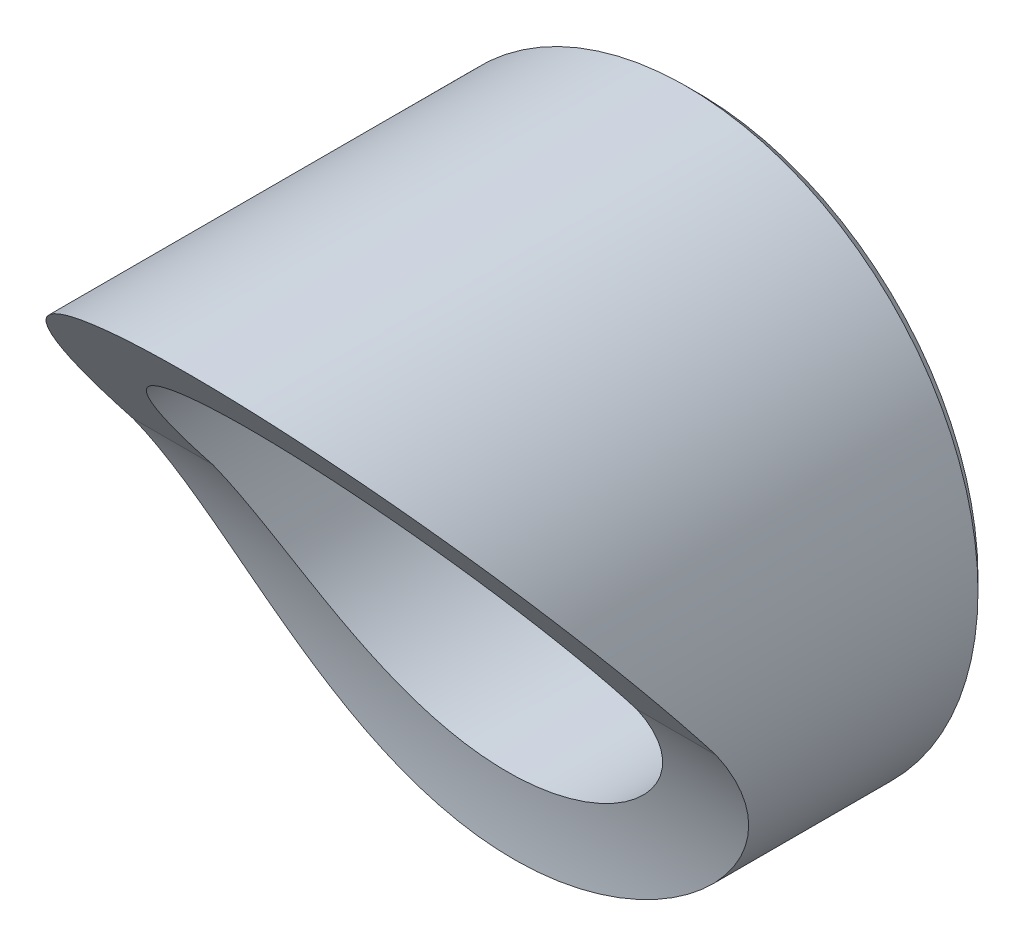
from build123d import *

# Parameters (mm, degrees)
SKETCH_1_R                    = 12
EXTRUDE_1_DEPTH               = 21
CUT_EXTRUDE_1_DEPTH           = 50
CHAMFER_1_SIZE                = 0.5
HOLE_WIZARD_M20_1_D           = 17.5
HOLE_WIZARD_M20_1_CSINK_D     = 20.05
HOLE_WIZARD_M20_1_CSINK_ANGLE = 90


with BuildPart() as part:
    # Sketch 1 → Extrude 1 (new body)
    with BuildSketch(Plane.XY):
        with Locations(Location((0, 0, 0), (0, 0, 180))):
            Circle(SKETCH_1_R)
    extrude(amount=EXTRUDE_1_DEPTH)

    # Sketch 2 → Cut-Extrude 1 (cut, symmetric)
    with BuildSketch(Plane(origin=(0, 0, 0), x_dir=(0, 0, -1), z_dir=(1, 0, 0))):
        with BuildLine():
            Line((-21, 12), (-11.264513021, -0.460855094))
            ThreePointArc((-11.264513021, -0.460855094), (-8.538130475, -5.946477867), (-7.6, -12))
            Line((-7.6, -12), (-18.148862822, -15.620173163))
            Line((-18.148862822, -15.620173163), (-30.110184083, -10.476312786))
            Line((-30.110184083, -10.476312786), (-21, 12))
        make_face()
    extrude(amount=CUT_EXTRUDE_1_DEPTH, both=True, mode=Mode.SUBTRACT)

    # Chamfer 1
    chamfer_1_edges = [part.edges().sort_by_distance(p)[0] for p in [
        (12, 0, 0),
    ]]
    chamfer(chamfer_1_edges, length=CHAMFER_1_SIZE)

    # Hole Wizard M20 _1 (through all)
    with Locations(Plane(origin=(0, 0, 0), x_dir=(-1, 0, 0), z_dir=(0, 0, -1))):
        with Locations((0, 0)):
            CounterSinkHole(HOLE_WIZARD_M20_1_D / 2, HOLE_WIZARD_M20_1_CSINK_D / 2, counter_sink_angle=HOLE_WIZARD_M20_1_CSINK_ANGLE)


solid = part.part
